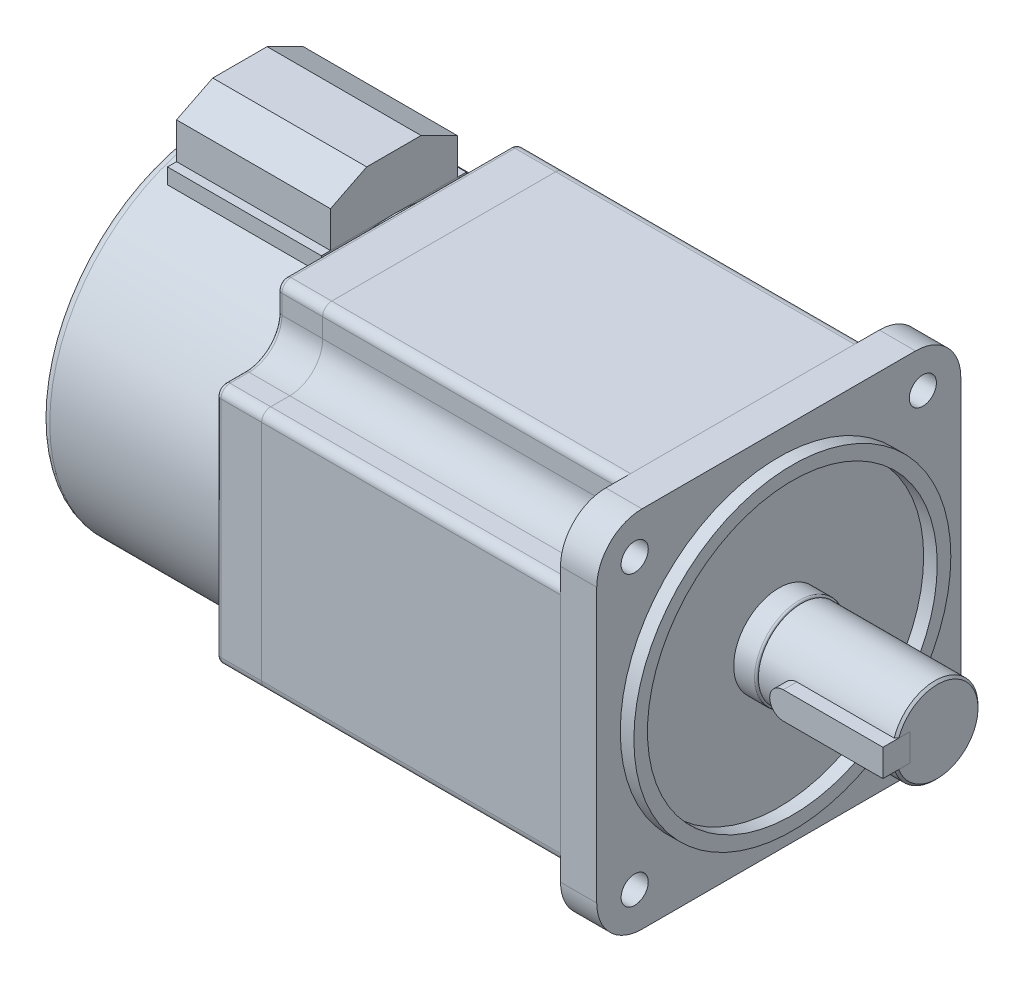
from build123d import *

# Parameters (mm, degrees)
EXTRUDE_1_DEPTH     = 8
EXTRUDE_2_DEPTH     = 66
EXTRUDE_3_DEPTH     = 10
CUT_EXTRUDE_1_DEPTH = 76
FILLET_1_R          = 1
SKETCH_5_R          = 3
CUT_EXTRUDE_2_DEPTH = 8
SKETCH_6_R          = 35
SKETCH_6_R_2        = 32
EXTRUDE_4_DEPTH     = 3
SKETCH_7_R          = 9.95
EXTRUDE_5_DEPTH     = 5
FILLET_2_R          = 0.4
SKETCH_8_R          = 9.5
EXTRUDE_6_DEPTH     = 30
CUT_EXTRUDE_3_DEPTH = 3.5
EXTRUDE_7_DEPTH     = 6
CHAMFER_1_SIZE      = 0.5
SKETCH_11_R         = 39
EXTRUDE_8_DEPTH     = 40
FILLET_3_R          = 2
SKETCH_38_W         = 34
SKETCH_38_H         = 32
CUT_EXTRUDE_8_DEPTH = 10
SKETCH_39_W         = 34
SKETCH_39_H         = 32
EXTRUDE_13_DEPTH    = 10
SKETCH_40_W         = 34
SKETCH_40_H         = 28
EXTRUDE_14_DEPTH    = 12
CUT_EXTRUDE_9_DEPTH = 34


with BuildPart() as part:
    # Sketch 1 → Extrude 1 (new body)
    with BuildSketch(Plane(origin=(0, 0, 0), x_dir=(0, 0, -1), z_dir=(1, 0, 0))):
        with BuildLine():
            Line((-30.2, -40.2), (30.2, -40.2))
            ThreePointArc((30.2, -40.2), (37.271067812, -37.271067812), (40.2, -30.2))
            Line((40.2, -30.2), (40.2, 30.2))
            ThreePointArc((40.2, 30.2), (37.271067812, 37.271067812), (30.2, 40.2))
            Line((30.2, 40.2), (-30.2, 40.2))
            ThreePointArc((-30.2, 40.2), (-37.271067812, 37.271067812), (-40.2, 30.2))
            Line((-40.2, 30.2), (-40.2, -30.2))
            ThreePointArc((-40.2, -30.2), (-37.271067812, -37.271067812), (-30.2, -40.2))
        make_face()
    extrude(amount=EXTRUDE_1_DEPTH)

    # Sketch 5 → Cut-Extrude 2 (cut)
    with BuildSketch(Plane(origin=(8, 0, 0), x_dir=(0, 0, -1), z_dir=(1, 0, 0))):
        with Locations((-31.819805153, 31.819805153)):
            Circle(SKETCH_5_R)
        with Locations((31.819805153, 31.819805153)):
            Circle(SKETCH_5_R)
        with Locations((-31.819805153, -31.819805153)):
            Circle(SKETCH_5_R)
        with Locations((31.819805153, -31.819805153)):
            Circle(SKETCH_5_R)
    extrude(amount=-CUT_EXTRUDE_2_DEPTH, mode=Mode.SUBTRACT)

    # Sketch 6 → Extrude 4 (add)
    with BuildSketch(Plane(origin=(8, 0, 0), x_dir=(0, 0, -1), z_dir=(1, 0, 0))):
        Circle(SKETCH_6_R)
        Circle(SKETCH_6_R_2, mode=Mode.SUBTRACT)
    extrude(amount=EXTRUDE_4_DEPTH)

    # Sketch 7 → Extrude 5 (add)
    with BuildSketch(Plane(origin=(8, 0, 0), x_dir=(0, 0, -1), z_dir=(1, 0, 0))):
        Circle(SKETCH_7_R)
    extrude(amount=EXTRUDE_5_DEPTH)

    # Fillet 2
    fillet_2_edges = [part.edges().sort_by_distance(p)[0] for p in [
        (13, 0, 9.95),
    ]]
    fillet(fillet_2_edges, radius=FILLET_2_R)


with BuildPart() as body_2:
    # Sketch 2 → Extrude 2 (new body)
    with BuildSketch(Plane.ZY):
        with BuildLine():
            Line((-30.2, -40.2), (30.2, -40.2))
            ThreePointArc((30.2, -40.2), (37.271067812, -37.271067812), (40.2, -30.2))
            Line((40.2, -30.2), (40.2, 30.2))
            ThreePointArc((40.2, 30.2), (37.271067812, 37.271067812), (30.2, 40.2))
            Line((30.2, 40.2), (-30.2, 40.2))
            ThreePointArc((-30.2, 40.2), (-37.271067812, 37.271067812), (-40.2, 30.2))
            Line((-40.2, 30.2), (-40.2, -30.2))
            ThreePointArc((-40.2, -30.2), (-37.271067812, -37.271067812), (-30.2, -40.2))
        make_face()
    extrude(amount=EXTRUDE_2_DEPTH)


with BuildPart() as body_3:
    # Sketch 3 → Extrude 3 (new body)
    with BuildSketch(Plane.ZY.offset(66)):
        with BuildLine():
            Line((-30.2, -40.2), (30.2, -40.2))
            ThreePointArc((30.2, -40.2), (37.271067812, -37.271067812), (40.2, -30.2))
            Line((40.2, -30.2), (40.2, 30.2))
            ThreePointArc((40.2, 30.2), (37.271067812, 37.271067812), (30.2, 40.2))
            Line((30.2, 40.2), (-30.2, 40.2))
            ThreePointArc((-30.2, 40.2), (-37.271067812, 37.271067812), (-40.2, 30.2))
            Line((-40.2, 30.2), (-40.2, -30.2))
            ThreePointArc((-40.2, -30.2), (-37.271067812, -37.271067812), (-30.2, -40.2))
        make_face()
    extrude(amount=EXTRUDE_3_DEPTH)


with BuildPart() as cut_extrude_1_tool:
    # Sketch 4 → Cut-Extrude 1 (new body)
    with BuildSketch(Plane.ZY.offset(76)):
        with BuildLine():
            Line((-34, -26.728136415), (-38.2, -26.728136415))
            ThreePointArc((-38.2, -26.728136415), (-39.614213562, -26.142349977), (-40.2, -24.728136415))
            Line((-40.2, -24.728136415), (-40.2, -30.2))
            ThreePointArc((-40.2, -30.2), (-37.271067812, -37.271067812), (-30.2, -40.2))
            Line((-30.2, -40.2), (-24.728136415, -40.2))
            ThreePointArc((-24.728136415, -40.2), (-26.142349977, -39.614213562), (-26.728136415, -38.2))
            Line((-26.728136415, -38.2), (-26.728136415, -34))
            ThreePointArc((-26.728136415, -34), (-28.858015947, -28.858015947), (-34, -26.728136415))
        make_face()
        with BuildLine():
            Line((-40.2, 24.728136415), (-40.2, 30.2))
            ThreePointArc((-40.2, 30.2), (-37.271067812, 37.271067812), (-30.2, 40.2))
            Line((-30.2, 40.2), (-24.728136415, 40.2))
            ThreePointArc((-24.728136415, 40.2), (-26.142349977, 39.614213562), (-26.728136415, 38.2))
            Line((-26.728136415, 38.2), (-26.728136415, 34))
            ThreePointArc((-26.728136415, 34), (-28.858015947, 28.858015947), (-34, 26.728136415))
            Line((-34, 26.728136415), (-38.2, 26.728136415))
            ThreePointArc((-38.2, 26.728136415), (-39.614213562, 26.142349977), (-40.2, 24.728136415))
        make_face()
        with BuildLine():
            Line((24.728136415, 40.2), (30.2, 40.2))
            ThreePointArc((30.2, 40.2), (37.271067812, 37.271067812), (40.2, 30.2))
            Line((40.2, 30.2), (40.2, 24.728136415))
            ThreePointArc((40.2, 24.728136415), (39.614213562, 26.142349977), (38.2, 26.728136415))
            Line((38.2, 26.728136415), (34, 26.728136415))
            ThreePointArc((34, 26.728136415), (28.858015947, 28.858015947), (26.728136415, 34))
            Line((26.728136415, 34), (26.728136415, 38.2))
            ThreePointArc((26.728136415, 38.2), (26.142349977, 39.614213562), (24.728136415, 40.2))
        make_face()
        with BuildLine():
            Line((40.2, -24.728136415), (40.2, -30.2))
            ThreePointArc((40.2, -30.2), (37.271067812, -37.271067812), (30.2, -40.2))
            Line((30.2, -40.2), (24.728136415, -40.2))
            ThreePointArc((24.728136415, -40.2), (26.142349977, -39.614213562), (26.728136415, -38.2))
            Line((26.728136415, -38.2), (26.728136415, -34))
            ThreePointArc((26.728136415, -34), (28.858015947, -28.858015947), (34, -26.728136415))
            Line((34, -26.728136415), (38.2, -26.728136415))
            ThreePointArc((38.2, -26.728136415), (39.614213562, -26.142349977), (40.2, -24.728136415))
        make_face()
    extrude(amount=-CUT_EXTRUDE_1_DEPTH)


with BuildPart() as body_2_1:
    add(body_2.part)

    # Cut-Extrude 1: cut by cut_extrude_1_tool
    add(cut_extrude_1_tool.part, mode=Mode.SUBTRACT)


with BuildPart() as body_3_1:
    add(body_3.part)

    # Cut-Extrude 1: cut by cut_extrude_1_tool
    add(cut_extrude_1_tool.part, mode=Mode.SUBTRACT)

    # Fillet 1
    fillet_1_edges = [body_3_1.edges().sort_by_distance(p)[0] for p in [
        (-76, -28.858015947, 28.858015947),
        (-76, -36.1, 26.728136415),
        (-76, -39.614213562, 26.142349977),
        (-76, -26.142349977, 39.614213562),
        (-76, -26.728136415, 36.1),
        (-76, 40.2, 0),
        (-76, 0, -40.2),
        (-76, -40.2, 0),
        (-76, 0, 40.2),
        (-76, -28.858015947, -28.858015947),
        (-76, -26.728136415, -36.1),
        (-76, -26.142349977, -39.614213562),
        (-76, -39.614213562, -26.142349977),
        (-76, -36.1, -26.728136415),
        (-76, 28.858015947, -28.858015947),
        (-76, 36.1, -26.728136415),
        (-76, 39.614213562, -26.142349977),
        (-76, 26.142349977, -39.614213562),
        (-76, 26.728136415, -36.1),
        (-76, 28.858015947, 28.858015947),
        (-76, 26.728136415, 36.1),
        (-76, 26.142349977, 39.614213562),
        (-76, 39.614213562, 26.142349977),
        (-76, 36.1, 26.728136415),
    ]]
    fillet(fillet_1_edges, radius=FILLET_1_R)


with BuildPart() as body_4:
    # Sketch 8 → Extrude 6 (new body)
    with BuildSketch(Plane(origin=(13, 0, 0), x_dir=(0, 0, -1), z_dir=(1, 0, 0))):
        Circle(SKETCH_8_R)
    extrude(amount=EXTRUDE_6_DEPTH)

    # Sketch 9 → Cut-Extrude 3 (cut)
    with BuildSketch(Plane.XY.offset(9.5)):
        with BuildLine():
            Line((21, 3), (43, 3))
            Line((43, 3), (43, -3))
            Line((43, -3), (21, -3))
            ThreePointArc((21, -3), (18, 0), (21, 3))
        make_face()
    extrude(amount=-CUT_EXTRUDE_3_DEPTH, mode=Mode.SUBTRACT)

    # Chamfer 1
    chamfer_1_edges = [body_4.edges().sort_by_distance(p)[0] for p in [
        (43, 9.377682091, -1.519565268),
    ]]
    chamfer(chamfer_1_edges, length=CHAMFER_1_SIZE)


with BuildPart() as body_5:
    # Sketch 10 → Extrude 7 (new body)
    with BuildSketch(Plane.XY.offset(6)):
        with BuildLine():
            Line((21, 3), (43, 3))
            Line((43, 3), (43, -3))
            Line((43, -3), (21, -3))
            ThreePointArc((21, -3), (18, 0), (21, 3))
        make_face()
    extrude(amount=EXTRUDE_7_DEPTH)


with BuildPart() as body_6:
    # Sketch 11 → Extrude 8 (new body)
    with BuildSketch(Plane.ZY.offset(76)):
        Circle(SKETCH_11_R)
    extrude(amount=EXTRUDE_8_DEPTH)

    # Fillet 3
    fillet_3_edges = [body_6.edges().sort_by_distance(p)[0] for p in [
        (-116, 0, -39),
    ]]
    fillet(fillet_3_edges, radius=FILLET_3_R)

    # Sketch 38 → Cut-Extrude 8 (cut)
    with BuildSketch(Plane(origin=(0, 39, 0), x_dir=(1, 0, 0), z_dir=(0, 1, 0))):
        with Locations((-94, 0)):
            Rectangle(SKETCH_38_W, SKETCH_38_H)
    extrude(amount=-CUT_EXTRUDE_8_DEPTH, mode=Mode.SUBTRACT)

    # Sketch 39 → Extrude 13 (add)
    with BuildSketch(Plane(origin=(0, 29, 0), x_dir=(1, 0, 0), z_dir=(0, 1, 0))):
        with Locations((-94, 0)):
            Rectangle(SKETCH_39_W, SKETCH_39_H)
    extrude(amount=EXTRUDE_13_DEPTH)


with BuildPart() as body_7:
    # Sketch 40 → Extrude 14 (new body)
    with BuildSketch(Plane(origin=(0, 39, 0), x_dir=(1, 0, 0), z_dir=(0, 1, 0))):
        with Locations((-94, 0)):
            Rectangle(SKETCH_40_W, SKETCH_40_H)
    extrude(amount=EXTRUDE_14_DEPTH)

    # Sketch 41 → Cut-Extrude 9 (cut)
    with BuildSketch(Plane.ZY.offset(111)):
        Polygon((-14, 51), (-14, 47), (-6, 51), align=None)
        Polygon((14, 51), (6, 51), (14, 47), align=None)
    extrude(amount=-CUT_EXTRUDE_9_DEPTH, mode=Mode.SUBTRACT)


solid = Compound([part.part, body_2_1.part, body_3_1.part, body_4.part, body_5.part, body_6.part, body_7.part])
